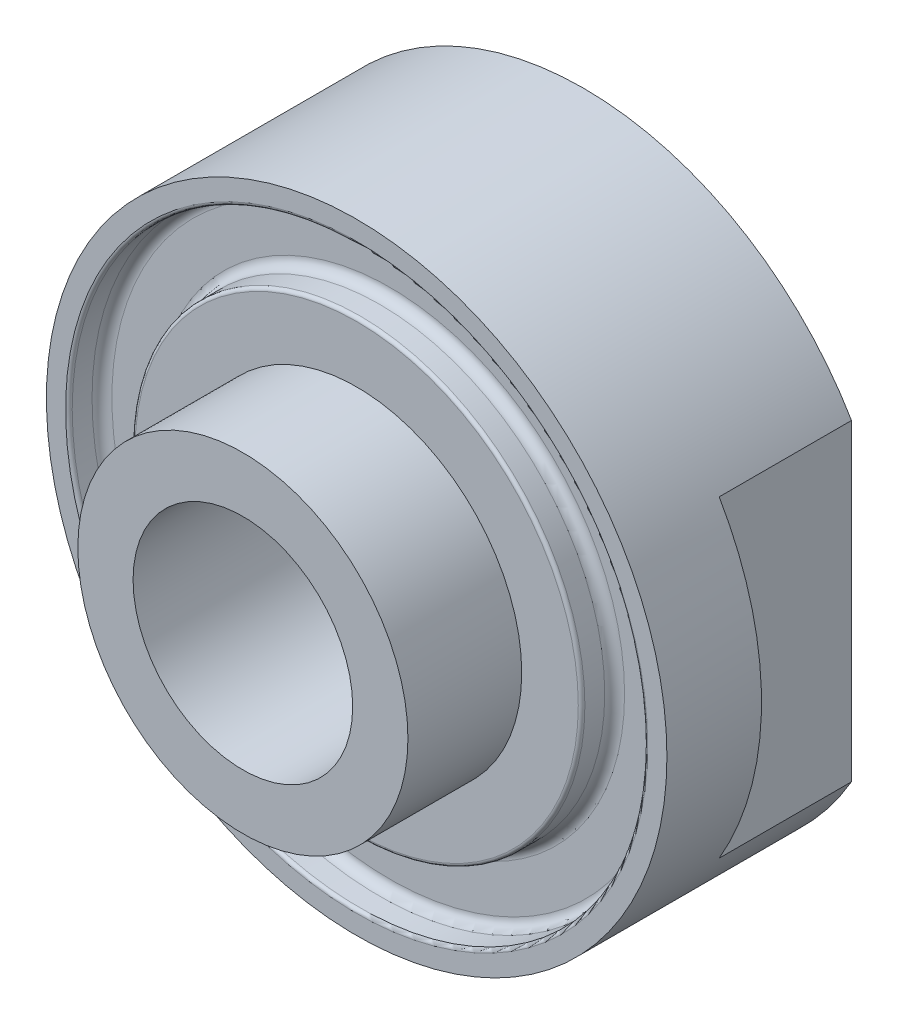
from build123d import *

# Parameters (mm, degrees)
SKETCH1_R           = 11.9126
BASE_EXTRUDE_DEPTH  = 8.7122
SKETCH2_R           = 6.3373
BOSS_EXTRUDE1_DEPTH = 4.3688
SKETCH3_R           = 4.2164
CUT_EXTRUDE1_DEPTH  = 22.329149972
SKETCH4_R           = 11.049
SKETCH4_R_2         = 8.636
CUT_EXTRUDE2_DEPTH  = 1.27
FILLET1_R           = 0.381
FILLET2_R           = 0.127
SKETCH5_W           = 15.781275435
SKETCH5_H           = 26.150171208
SKETCH5_W_2         = 14.106205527
CUT_EXTRUDE3_DEPTH  = 5.08


with BuildPart() as part:
    # Sketch1 → Base-Extrude (new body)
    with BuildSketch(Plane.XY):
        with Locations(Location((0, 0, 0), (0, 0, 149.716345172))):
            Circle(SKETCH1_R)
    extrude(amount=BASE_EXTRUDE_DEPTH)

    # Sketch2 → Boss-Extrude1 (add)
    with BuildSketch(Plane.XY.offset(8.7122)):
        Circle(SKETCH2_R)
    extrude(amount=BOSS_EXTRUDE1_DEPTH)

    # Sketch3 → Cut-Extrude1 (cut, through all)
    with BuildSketch(Plane.XY.offset(13.081)):
        Circle(SKETCH3_R)
    extrude(amount=-CUT_EXTRUDE1_DEPTH, mode=Mode.SUBTRACT)

    # Sketch4 → Cut-Extrude2 (cut)
    with BuildSketch(Plane.XY.offset(8.7122)):
        Circle(SKETCH4_R)
        Circle(SKETCH4_R_2, mode=Mode.SUBTRACT)
    extrude(amount=-CUT_EXTRUDE2_DEPTH, mode=Mode.SUBTRACT)

    # Fillet1
    fillet1_edges = [part.edges().sort_by_distance(p)[0] for p in [
        (-11.049, 0, 7.4422),
        (-8.636, 0, 7.4422),
    ]]
    fillet(fillet1_edges, radius=FILLET1_R)

    # Fillet2
    fillet2_edges = [part.edges().sort_by_distance(p)[0] for p in [
        (-11.049, 0, 8.7122),
        (-8.636, 0, 8.7122),
    ]]
    fillet(fillet2_edges, radius=FILLET2_R)

    # Sketch5 → Cut-Extrude3 (cut)
    with BuildSketch(Plane(origin=(0, 0, 0), x_dir=(-1, 0, 0), z_dir=(0, 0, -1))):
        with Locations((18.177637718, -0.069058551)):
            Rectangle(SKETCH5_W, SKETCH5_H)
        with Locations((-17.340102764, -0.069058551)):
            Rectangle(SKETCH5_W_2, SKETCH5_H)
    extrude(amount=-CUT_EXTRUDE3_DEPTH, mode=Mode.SUBTRACT)


solid = part.part
